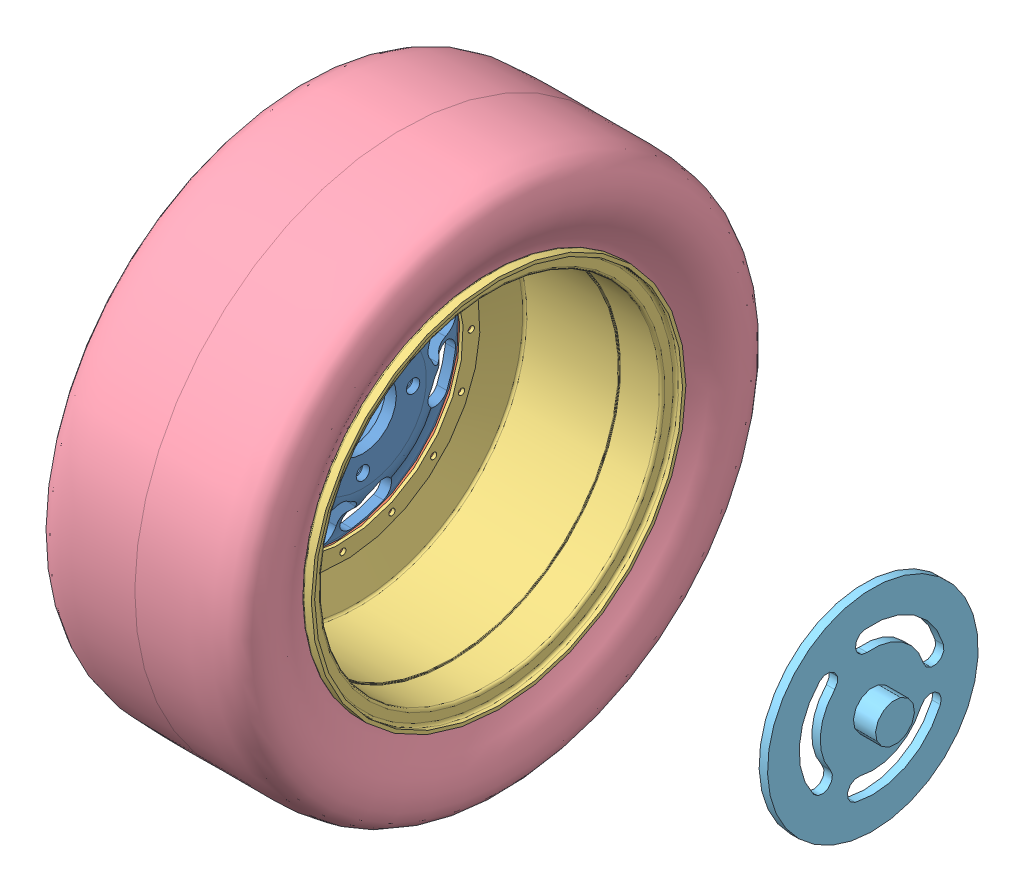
SolidWorks assembly Rear Axle Assembly_Final.SLDASM, configuration Default (file format 13000). Lengths in mm.
Overall size (571.48 563.63 563.63).
6 component instances, 5 part files, 4 mates.
Components (placement in the parent):
- Wheel Assembly_Final-1: Wheel Assembly_Final.SLDASM [Default] at (-750 0 0) x (0 0 1) z (-1 0 0) size (563.63 563.63 207.68)
  - Wheel Center - Aluminum_Final-1: Wheel Center - Aluminum_Final.SLDPRT [Default] at origin size (260.35 260.35 36.14)
  - Wheel Shell - Outer_Final-1: Wheel Shell - Outer_Final.SLDPRT [Default] at (0 0 -3.175) x (0 0 1) z (-0.92388 -0.382683 0) size (31.75 355.6 355.6)
  - Wheel Shell - Inner_Final-1: Wheel Shell - Inner_Final.SLDPRT [Default] at (0 0 -3.175) x (0 0 1) z (-0.707107 -0.707107 0) size (151 355.6 355.6)
  - Tire_Final-1: Tire_Final.SLDPRT [Default] at (0 0 -62.8015) x (0 0 -1) z (0.993511 0.113735 0) size (207.68 509.04 509.04)
- Sprocket_Final-1: Sprocket_Final.SLDPRT [Default] at (-244.5574 0 0) x (1 0 0) z (0 0.064209 0.997936) size (50 200 200)
Mates (geometry in assembly coordinates):
- Distance1: distance = 750 mm anti-aligned: plane of Wheel Assembly_Final-1 through (-750 0 0) normal (-1 0 0); plane of assembly through (0 0 0) normal (1 0 0)
- Coincident2: coincident aligned: plane of Wheel Assembly_Final-1 through (-750 0 0) normal (0 1 0); plane of assembly through (0 0 0) normal (0 1 0)
- Coincident3: coincident aligned: plane of Wheel Assembly_Final-1 through (-750 0 0) normal (0 0 1); plane of assembly through (0 0 0) normal (0 0 1)
- Concentric1: concentric aligned: cylinder of Sprocket_Final-1 through (-219.5574 0 0) axis (1 0 0) radius 18.5
